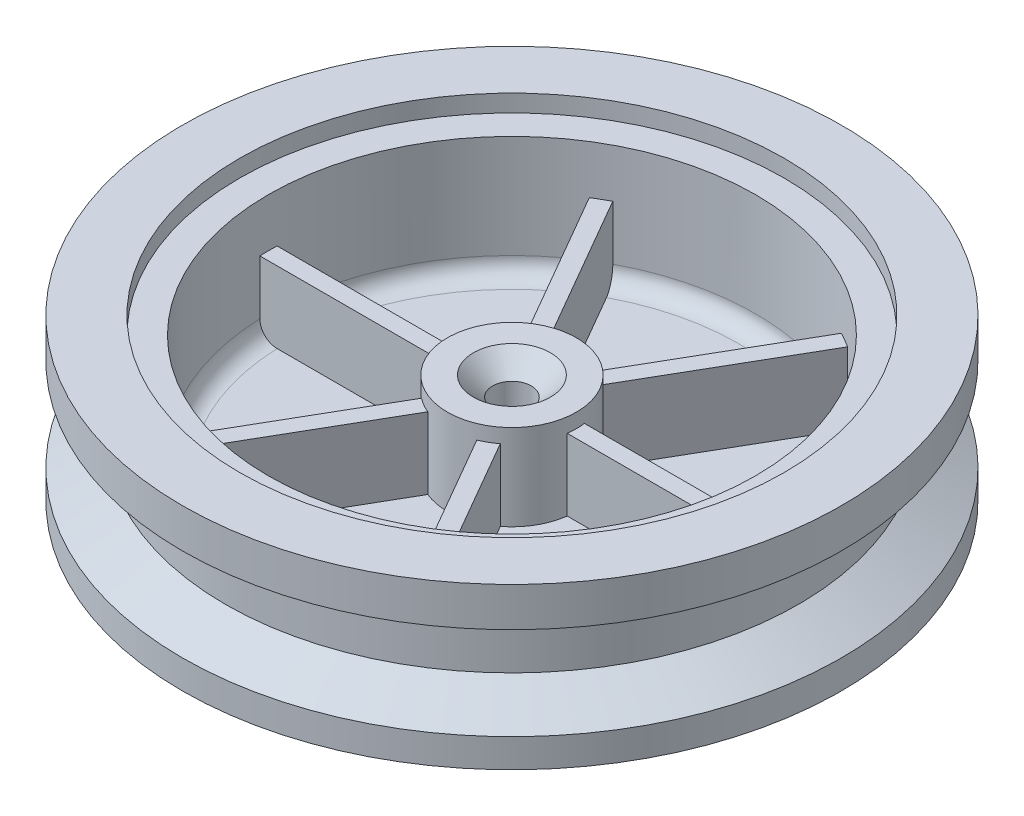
from build123d import *

# Parameters (mm, degrees)
FILLET1_R                                            = 6
RIB1_REACH                                           = 170.745
SKETCH13_WALLS_W                                     = 401.990740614
SKETCH13_WALLS_H                                     = 6
CIRPATTERN4_COUNT                                    = 6
SKETCH14_R                                           = 5.75
CUT_EXTRUDE5_DEPTH                                   = 177.278189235
CSK_FOR_M12_HEX_SOCKET_COUNTERSUNK_CAP_S_D           = 13.5
CSK_FOR_M12_HEX_SOCKET_COUNTERSUNK_CAP_S_CSINK_D     = 26.88
CSK_FOR_M12_HEX_SOCKET_COUNTERSUNK_CAP_S_CSINK_ANGLE = 90


with BuildPart() as part:
    # Sketch1 → Revolve2 (revolve)
    with BuildSketch(Plane.XY, mode=Mode.PRIVATE) as revolve2_sk:
        Polygon((0, 0), (93, 0), (93, 12), (115, 12), (115, 22), (100, 30.660254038), (100, 45.660254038), (115, 54.320508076), (115, 68), (95, 68), (95, 62), (85, 62), (85, 20), (22.5, 20), (22.5, 50), (0, 50), align=None)
    revolve(revolve2_sk.sketch.rotate(Axis((0, 0, 0), (0, -1, 0)), 90), axis=Axis((0, 0, 0), (0, -1, 0)))

    # Fillet1
    fillet1_edges = [part.edges().sort_by_distance(p)[0] for p in [
        (0, 20, -85),
    ]]
    fillet(fillet1_edges, radius=FILLET1_R)

    # Sketch13 walls → Rib1 (add, up to next)
    with BuildSketch(Plane(origin=(0, 45, 0), x_dir=(1, 0, 0), z_dir=(0, 1, 0)), mode=Mode.PRIVATE) as rib1_sk1:
        with Locations((53.75, 0)):
            Rectangle(SKETCH13_WALLS_W, SKETCH13_WALLS_H)
    rib1_tool1 = extrude(rib1_sk1.sketch, amount=-RIB1_REACH, mode=Mode.PRIVATE) - part.part
    rib1 = rib1_tool1.solids().sort_by_distance((53.75, 45, 0))[0]
    add(rib1)

    # CirPattern4: Rib1 ×6 about axis
    cirpattern4_axis = Axis((0, 0, 0), (0, 1, 0))
    for i in range(1, CIRPATTERN4_COUNT):
        add(rib1.rotate(cirpattern4_axis, i * 360 / CIRPATTERN4_COUNT))

    # Sketch14 → Cut-Extrude5 (cut, through all)
    with BuildSketch(Plane(origin=(0, 0, 0), x_dir=(1, 0, 0), z_dir=(0, 1, 0))):
        with Locations(Location((0, 60, 0), (0, 0, 90))):
            Circle(SKETCH14_R)
        with Locations(Location((0, -60, 0), (0, 0, 90))):
            Circle(SKETCH14_R)
    extrude(amount=CUT_EXTRUDE5_DEPTH, mode=Mode.SUBTRACT)

    # CSK for M12 Hex Socket Countersunk Cap S (through all)
    with Locations(Plane(origin=(0, 50, 0), x_dir=(1, 0, 0), z_dir=(0, 1, 0))):
        with Locations((0, 0)):
            CounterSinkHole(CSK_FOR_M12_HEX_SOCKET_COUNTERSUNK_CAP_S_D / 2, CSK_FOR_M12_HEX_SOCKET_COUNTERSUNK_CAP_S_CSINK_D / 2, counter_sink_angle=CSK_FOR_M12_HEX_SOCKET_COUNTERSUNK_CAP_S_CSINK_ANGLE)


solid = part.part
